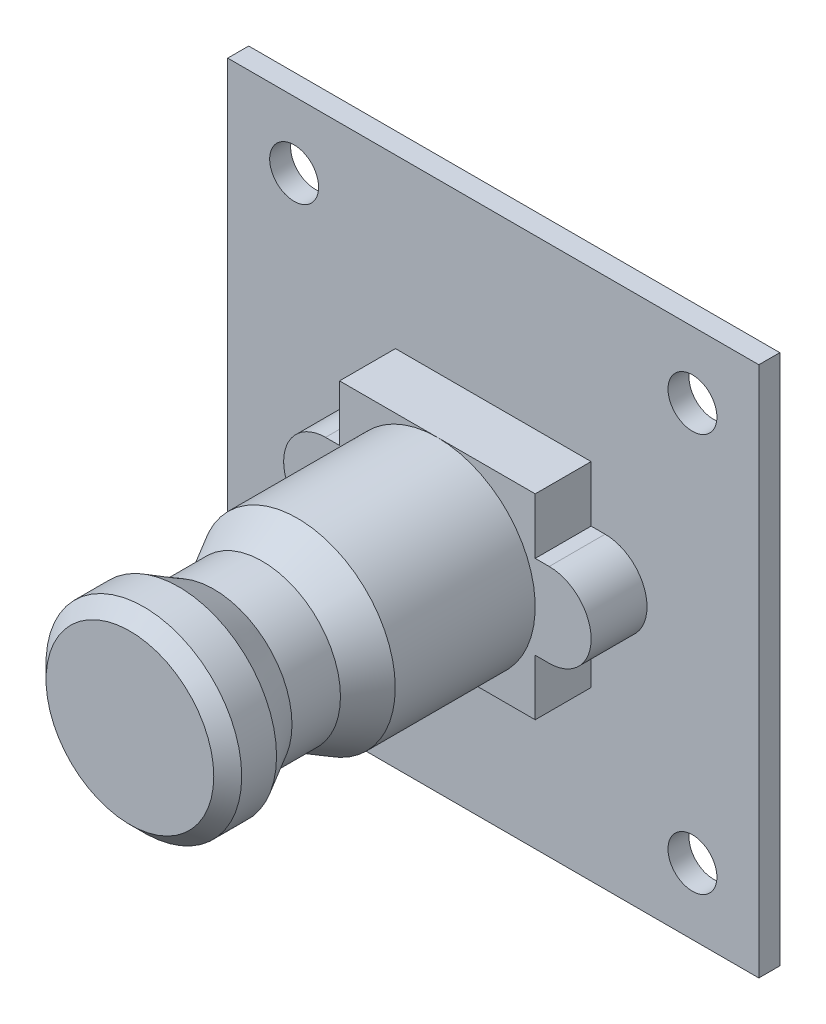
from build123d import *

# Parameters (mm, degrees)
SKETCH_1_W                  = 38
SKETCH_1_H                  = 38
EXTRUDE_1_DEPTH             = 1.5
HOLE_WIZARD_3_5_3_5_1_D     = 3.5
HOLE_WIZARD_3_5_3_5_1_DEPTH = 5
HOLE_WIZARD_3_5_3_5_1_TIP   = 1.051506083
SKETCH_4_W                  = 14
SKETCH_4_H                  = 14
EXTRUDE_2_DEPTH             = 4
EXTRUDE_3_DEPTH             = 4
SKETCH_6_R                  = 7
EXTRUDE_4_DEPTH             = 22
CHAMFER_1_SIZE              = 1
SKETCH_9_W                  = 10
SKETCH_9_H                  = 6
EXTRUDE_5_DEPTH             = 6


with BuildPart() as part:
    # Sketch 1 → Extrude 1 (new body)
    with BuildSketch(Plane.XY):
        Rectangle(SKETCH_1_W, SKETCH_1_H)
    extrude(amount=EXTRUDE_1_DEPTH)

    # Hole Wizard 3.5 _3.5_ _1
    with Locations(Plane.XY.offset(1.5)):
        with Locations((-14.25, 14.25), (14.25, 14.25), (14.25, -14.25), (-14.25, -14.25)):
            Hole(HOLE_WIZARD_3_5_3_5_1_D / 2, depth=HOLE_WIZARD_3_5_3_5_1_DEPTH)
            with Locations((0, 0, -(HOLE_WIZARD_3_5_3_5_1_DEPTH + HOLE_WIZARD_3_5_3_5_1_TIP / 2))):  # 118° drill point
                Cone(0, HOLE_WIZARD_3_5_3_5_1_D / 2, HOLE_WIZARD_3_5_3_5_1_TIP, mode=Mode.SUBTRACT)

    # Sketch 4 → Extrude 2 (add)
    with BuildSketch(Plane.XY.offset(1.5)):
        Rectangle(SKETCH_4_W, SKETCH_4_H)
    extrude(amount=EXTRUDE_2_DEPTH)

    # Sketch 5 → Extrude 3 (add)
    with BuildSketch(Plane.XY.offset(5.5)):
        with BuildLine():
            Line((-8, 3), (8, 3))
            ThreePointArc((8, 3), (11, 0), (8, -3))
            Line((8, -3), (-8, -3))
            ThreePointArc((-8, -3), (-11, 0), (-8, 3))
        make_face()
    extrude(amount=-EXTRUDE_3_DEPTH)

    # Sketch 6 → Extrude 4 (add)
    with BuildSketch(Plane.XY.offset(5.5)):
        with Locations(Location((0, 0, 0), (0, 0, 270))):
            Circle(SKETCH_6_R)
    extrude(amount=EXTRUDE_4_DEPTH)

    # Chamfer 1
    chamfer_1_edges = [part.edges().sort_by_distance(p)[0] for p in [
        (0, 7, 27.5),
    ]]
    chamfer(chamfer_1_edges, length=CHAMFER_1_SIZE)

    # Sketch 8 → Cut-Revolve 1 (revolve, cut)
    with BuildSketch(Plane(origin=(0, 0, 0), x_dir=(1, 0, 0), z_dir=(0, 1, 0))):
        Polygon((7, -24.00639225), (5.591677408, -21.49462272), (5.591677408, -18.025988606), (7, -15.514219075), align=None)
    revolve(axis=Axis((0, 0, 26.5), (0, 0, -1)), mode=Mode.SUBTRACT)

    # Sketch 9 → Extrude 5 (add)
    with BuildSketch(Plane(origin=(0, 0, 0), x_dir=(-1, 0, 0), z_dir=(0, 0, -1))):
        with Locations((-5, -13)):
            Rectangle(SKETCH_9_W, SKETCH_9_H)
    extrude(amount=EXTRUDE_5_DEPTH)


solid = part.part
